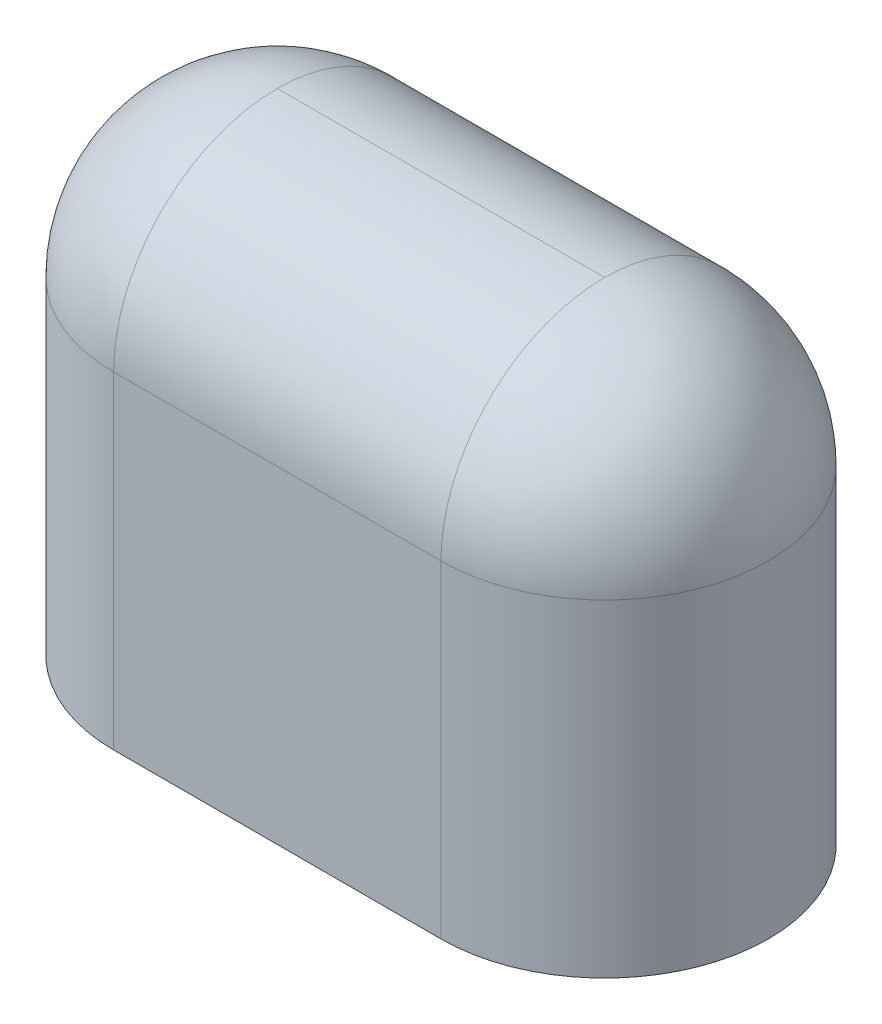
ISO-10303-21;
HEADER;
FILE_DESCRIPTION(('STEP AP214'),'2;1');
FILE_NAME('part.step','',(''),(''),'','','');
FILE_SCHEMA(('AUTOMOTIVE_DESIGN { 1 0 10303 214 1 1 1 1 }'));
ENDSEC;
DATA;
#1=APPLICATION_CONTEXT('core data for automotive mechanical design processes');
#2=APPLICATION_PROTOCOL_DEFINITION('international standard','automotive_design',2000,#1);
#3=PRODUCT_CONTEXT('',#1,'mechanical');
#4=PRODUCT('Part','Part','',(#3));
#5=PRODUCT_RELATED_PRODUCT_CATEGORY('part','',(#4));
#6=PRODUCT_DEFINITION_FORMATION('','',#4);
#7=PRODUCT_DEFINITION_CONTEXT('part definition',#1,'design');
#8=PRODUCT_DEFINITION('design','',#6,#7);
#9=PRODUCT_DEFINITION_SHAPE('','',#8);
#10=(LENGTH_UNIT() NAMED_UNIT(*) SI_UNIT(.MILLI.,.METRE.));
#11=(NAMED_UNIT(*) PLANE_ANGLE_UNIT() SI_UNIT($,.RADIAN.));
#12=(NAMED_UNIT(*) SI_UNIT($,.STERADIAN.) SOLID_ANGLE_UNIT());
#13=UNCERTAINTY_MEASURE_WITH_UNIT(LENGTH_MEASURE(1.E-05),#10,'distance_accuracy_value','');
#14=(GEOMETRIC_REPRESENTATION_CONTEXT(3) GLOBAL_UNCERTAINTY_ASSIGNED_CONTEXT((#13)) GLOBAL_UNIT_ASSIGNED_CONTEXT((#10,
#11,#12)) REPRESENTATION_CONTEXT('',''));
#15=CARTESIAN_POINT('',(0.,0.,0.));
#16=DIRECTION('',(0.,0.,1.));
#17=DIRECTION('',(1.,0.,0.));
#18=AXIS2_PLACEMENT_3D('',#15,#16,#17);
#19=CARTESIAN_POINT('',(-3.,9.,0.));
#20=DIRECTION('',(0.,-1.,0.));
#21=DIRECTION('',(0.,0.,-1.));
#22=AXIS2_PLACEMENT_3D('',#19,#20,#21);
#23=CYLINDRICAL_SURFACE('',#22,3.);
#24=DIRECTION('',(0.,-1.,0.));
#25=VECTOR('',#24,1.);
#26=CARTESIAN_POINT('',(-3.,9.,3.));
#27=LINE('',#26,#25);
#28=CARTESIAN_POINT('',(-3.,6.,3.));
#29=VERTEX_POINT('',#28);
#30=CARTESIAN_POINT('',(-3.,0.,3.));
#31=VERTEX_POINT('',#30);
#32=EDGE_CURVE('E79',#29,#31,#27,.T.);
#33=ORIENTED_EDGE('',*,*,#32,.F.);
#34=CARTESIAN_POINT('',(-3.,6.,0.));
#35=DIRECTION('',(0.,-1.,0.));
#36=DIRECTION('',(0.,0.,-1.));
#37=AXIS2_PLACEMENT_3D('',#34,#35,#36);
#38=CIRCLE('',#37,3.);
#39=CARTESIAN_POINT('',(-3.,6.,-3.));
#40=VERTEX_POINT('',#39);
#41=EDGE_CURVE('E102',#29,#40,#38,.T.);
#42=ORIENTED_EDGE('',*,*,#41,.T.);
#43=DIRECTION('',(0.,-1.,0.));
#44=VECTOR('',#43,1.);
#45=CARTESIAN_POINT('',(-3.,9.,-3.));
#46=LINE('',#45,#44);
#47=CARTESIAN_POINT('',(-3.,0.,-3.));
#48=VERTEX_POINT('',#47);
#49=EDGE_CURVE('E130',#40,#48,#46,.T.);
#50=ORIENTED_EDGE('',*,*,#49,.T.);
#51=CARTESIAN_POINT('',(-3.,0.,0.));
#52=DIRECTION('',(0.,1.,0.));
#53=DIRECTION('',(0.,0.,1.));
#54=AXIS2_PLACEMENT_3D('',#51,#52,#53);
#55=CIRCLE('',#54,3.);
#56=EDGE_CURVE('E111',#48,#31,#55,.T.);
#57=ORIENTED_EDGE('',*,*,#56,.T.);
#58=EDGE_LOOP('',(#33,#42,#50,#57));
#59=FACE_BOUND('',#58,.T.);
#60=ADVANCED_FACE('F35',(#59),#23,.T.);
#61=CARTESIAN_POINT('',(-3.,9.,3.));
#62=DIRECTION('',(0.,0.,-1.));
#63=DIRECTION('',(-1.,0.,0.));
#64=AXIS2_PLACEMENT_3D('',#61,#62,#63);
#65=PLANE('',#64);
#66=DIRECTION('',(0.,-1.,0.));
#67=VECTOR('',#66,1.);
#68=CARTESIAN_POINT('',(3.,9.,3.));
#69=LINE('',#68,#67);
#70=CARTESIAN_POINT('',(3.,6.,3.));
#71=VERTEX_POINT('',#70);
#72=CARTESIAN_POINT('',(3.,0.,3.));
#73=VERTEX_POINT('',#72);
#74=EDGE_CURVE('E107',#71,#73,#69,.T.);
#75=ORIENTED_EDGE('',*,*,#74,.F.);
#76=DIRECTION('',(1.,0.,0.));
#77=VECTOR('',#76,1.);
#78=CARTESIAN_POINT('',(-3.,6.,3.));
#79=LINE('',#78,#77);
#80=EDGE_CURVE('E98',#71,#29,#79,.F.);
#81=ORIENTED_EDGE('',*,*,#80,.T.);
#82=ORIENTED_EDGE('',*,*,#32,.T.);
#83=DIRECTION('',(1.,0.,0.));
#84=VECTOR('',#83,1.);
#85=CARTESIAN_POINT('',(-3.,0.,3.));
#86=LINE('',#85,#84);
#87=EDGE_CURVE('E120',#31,#73,#86,.T.);
#88=ORIENTED_EDGE('',*,*,#87,.T.);
#89=EDGE_LOOP('',(#75,#81,#82,#88));
#90=FACE_BOUND('',#89,.T.);
#91=ADVANCED_FACE('F106',(#90),#65,.F.);
#92=CARTESIAN_POINT('',(3.,9.,0.));
#93=DIRECTION('',(0.,-1.,0.));
#94=DIRECTION('',(0.,0.,-1.));
#95=AXIS2_PLACEMENT_3D('',#92,#93,#94);
#96=CYLINDRICAL_SURFACE('',#95,3.);
#97=DIRECTION('',(0.,-1.,0.));
#98=VECTOR('',#97,1.);
#99=CARTESIAN_POINT('',(3.,9.,-3.));
#100=LINE('',#99,#98);
#101=CARTESIAN_POINT('',(3.,6.,-3.));
#102=VERTEX_POINT('',#101);
#103=CARTESIAN_POINT('',(3.,0.,-3.));
#104=VERTEX_POINT('',#103);
#105=EDGE_CURVE('E113',#102,#104,#100,.T.);
#106=ORIENTED_EDGE('',*,*,#105,.F.);
#107=CARTESIAN_POINT('',(3.,6.,0.));
#108=DIRECTION('',(0.,-1.,0.));
#109=DIRECTION('',(0.,0.,-1.));
#110=AXIS2_PLACEMENT_3D('',#107,#108,#109);
#111=CIRCLE('',#110,3.);
#112=EDGE_CURVE('E11',#102,#71,#111,.T.);
#113=ORIENTED_EDGE('',*,*,#112,.T.);
#114=ORIENTED_EDGE('',*,*,#74,.T.);
#115=CARTESIAN_POINT('',(3.,0.,0.));
#116=DIRECTION('',(0.,1.,0.));
#117=DIRECTION('',(0.,0.,1.));
#118=AXIS2_PLACEMENT_3D('',#115,#116,#117);
#119=CIRCLE('',#118,3.);
#120=EDGE_CURVE('E122',#73,#104,#119,.T.);
#121=ORIENTED_EDGE('',*,*,#120,.T.);
#122=EDGE_LOOP('',(#106,#113,#114,#121));
#123=FACE_BOUND('',#122,.T.);
#124=ADVANCED_FACE('F135',(#123),#96,.T.);
#125=CARTESIAN_POINT('',(-3.,9.,-3.));
#126=DIRECTION('',(0.,0.,1.));
#127=DIRECTION('',(1.,0.,0.));
#128=AXIS2_PLACEMENT_3D('',#125,#126,#127);
#129=PLANE('',#128);
#130=ORIENTED_EDGE('',*,*,#49,.F.);
#131=DIRECTION('',(-1.,0.,0.));
#132=VECTOR('',#131,1.);
#133=CARTESIAN_POINT('',(3.,6.,-3.));
#134=LINE('',#133,#132);
#135=EDGE_CURVE('E45',#40,#102,#134,.F.);
#136=ORIENTED_EDGE('',*,*,#135,.T.);
#137=ORIENTED_EDGE('',*,*,#105,.T.);
#138=DIRECTION('',(-1.,0.,0.));
#139=VECTOR('',#138,1.);
#140=CARTESIAN_POINT('',(-3.,0.,-3.));
#141=LINE('',#140,#139);
#142=EDGE_CURVE('E127',#104,#48,#141,.T.);
#143=ORIENTED_EDGE('',*,*,#142,.T.);
#144=EDGE_LOOP('',(#130,#136,#137,#143));
#145=FACE_BOUND('',#144,.T.);
#146=ADVANCED_FACE('F131',(#145),#129,.F.);
#147=CARTESIAN_POINT('',(-3.,0.,0.));
#148=DIRECTION('',(0.,1.,0.));
#149=DIRECTION('',(0.,0.,1.));
#150=AXIS2_PLACEMENT_3D('',#147,#148,#149);
#151=PLANE('',#150);
#152=ORIENTED_EDGE('',*,*,#56,.F.);
#153=ORIENTED_EDGE('',*,*,#142,.F.);
#154=ORIENTED_EDGE('',*,*,#120,.F.);
#155=ORIENTED_EDGE('',*,*,#87,.F.);
#156=EDGE_LOOP('',(#152,#153,#154,#155));
#157=FACE_BOUND('',#156,.T.);
#158=ADVANCED_FACE('F137',(#157),#151,.F.);
#159=CARTESIAN_POINT('',(-3.,6.,0.));
#160=DIRECTION('',(0.,1.,0.));
#161=DIRECTION('',(0.,0.,1.));
#162=AXIS2_PLACEMENT_3D('',#159,#160,#161);
#163=SPHERICAL_SURFACE('',#162,3.);
#164=CARTESIAN_POINT('',(-3.,6.,0.));
#165=DIRECTION('',(1.,0.,0.));
#166=DIRECTION('',(0.,0.,-1.));
#167=AXIS2_PLACEMENT_3D('',#164,#165,#166);
#168=CIRCLE('',#167,3.);
#169=CARTESIAN_POINT('',(-3.,9.,0.));
#170=VERTEX_POINT('',#169);
#171=EDGE_CURVE('E39',#40,#170,#168,.T.);
#172=ORIENTED_EDGE('',*,*,#171,.F.);
#173=ORIENTED_EDGE('',*,*,#41,.F.);
#174=CARTESIAN_POINT('',(-3.,6.,0.));
#175=DIRECTION('',(1.,0.,0.));
#176=DIRECTION('',(0.,0.,-1.));
#177=AXIS2_PLACEMENT_3D('',#174,#175,#176);
#178=CIRCLE('',#177,3.);
#179=EDGE_CURVE('E94',#170,#29,#178,.T.);
#180=ORIENTED_EDGE('',*,*,#179,.F.);
#181=EDGE_LOOP('',(#172,#173,#180));
#182=FACE_BOUND('',#181,.T.);
#183=ADVANCED_FACE('F37',(#182),#163,.T.);
#184=CARTESIAN_POINT('',(-3.,6.,0.));
#185=DIRECTION('',(1.,0.,0.));
#186=DIRECTION('',(0.,0.,-1.));
#187=AXIS2_PLACEMENT_3D('',#184,#185,#186);
#188=CYLINDRICAL_SURFACE('',#187,3.);
#189=CARTESIAN_POINT('',(3.,6.,0.));
#190=DIRECTION('',(1.,0.,0.));
#191=DIRECTION('',(0.,0.,-1.));
#192=AXIS2_PLACEMENT_3D('',#189,#190,#191);
#193=CIRCLE('',#192,3.);
#194=CARTESIAN_POINT('',(3.,9.,0.));
#195=VERTEX_POINT('',#194);
#196=EDGE_CURVE('E65',#102,#195,#193,.T.);
#197=ORIENTED_EDGE('',*,*,#196,.F.);
#198=ORIENTED_EDGE('',*,*,#135,.F.);
#199=ORIENTED_EDGE('',*,*,#171,.T.);
#200=DIRECTION('',(-1.,0.,0.));
#201=VECTOR('',#200,1.);
#202=CARTESIAN_POINT('',(-3.,9.,0.));
#203=LINE('',#202,#201);
#204=EDGE_CURVE('E99',#195,#170,#203,.T.);
#205=ORIENTED_EDGE('',*,*,#204,.F.);
#206=EDGE_LOOP('',(#197,#198,#199,#205));
#207=FACE_BOUND('',#206,.T.);
#208=ADVANCED_FACE('F144',(#207),#188,.T.);
#209=CARTESIAN_POINT('',(3.,6.,0.));
#210=DIRECTION('',(0.,1.,0.));
#211=DIRECTION('',(0.,0.,1.));
#212=AXIS2_PLACEMENT_3D('',#209,#210,#211);
#213=SPHERICAL_SURFACE('',#212,3.);
#214=ORIENTED_EDGE('',*,*,#112,.F.);
#215=ORIENTED_EDGE('',*,*,#196,.T.);
#216=CARTESIAN_POINT('',(3.,6.,0.));
#217=DIRECTION('',(-1.,0.,0.));
#218=DIRECTION('',(0.,0.,1.));
#219=AXIS2_PLACEMENT_3D('',#216,#217,#218);
#220=CIRCLE('',#219,3.);
#221=EDGE_CURVE('E118',#71,#195,#220,.T.);
#222=ORIENTED_EDGE('',*,*,#221,.F.);
#223=EDGE_LOOP('',(#214,#215,#222));
#224=FACE_BOUND('',#223,.T.);
#225=ADVANCED_FACE('F156',(#224),#213,.T.);
#226=CARTESIAN_POINT('',(-3.,6.,0.));
#227=DIRECTION('',(-1.,0.,0.));
#228=DIRECTION('',(0.,0.,1.));
#229=AXIS2_PLACEMENT_3D('',#226,#227,#228);
#230=CYLINDRICAL_SURFACE('',#229,3.);
#231=ORIENTED_EDGE('',*,*,#179,.T.);
#232=ORIENTED_EDGE('',*,*,#80,.F.);
#233=ORIENTED_EDGE('',*,*,#221,.T.);
#234=ORIENTED_EDGE('',*,*,#204,.T.);
#235=EDGE_LOOP('',(#231,#232,#233,#234));
#236=FACE_BOUND('',#235,.T.);
#237=ADVANCED_FACE('F96',(#236),#230,.T.);
#238=CLOSED_SHELL('',(#60,#91,#124,#146,#158,#183,#208,#225,#237));
#239=MANIFOLD_SOLID_BREP('B2',#238);
#240=ADVANCED_BREP_SHAPE_REPRESENTATION('',(#18,#239),#14);
#241=SHAPE_DEFINITION_REPRESENTATION(#9,#240);
ENDSEC;
END-ISO-10303-21;
